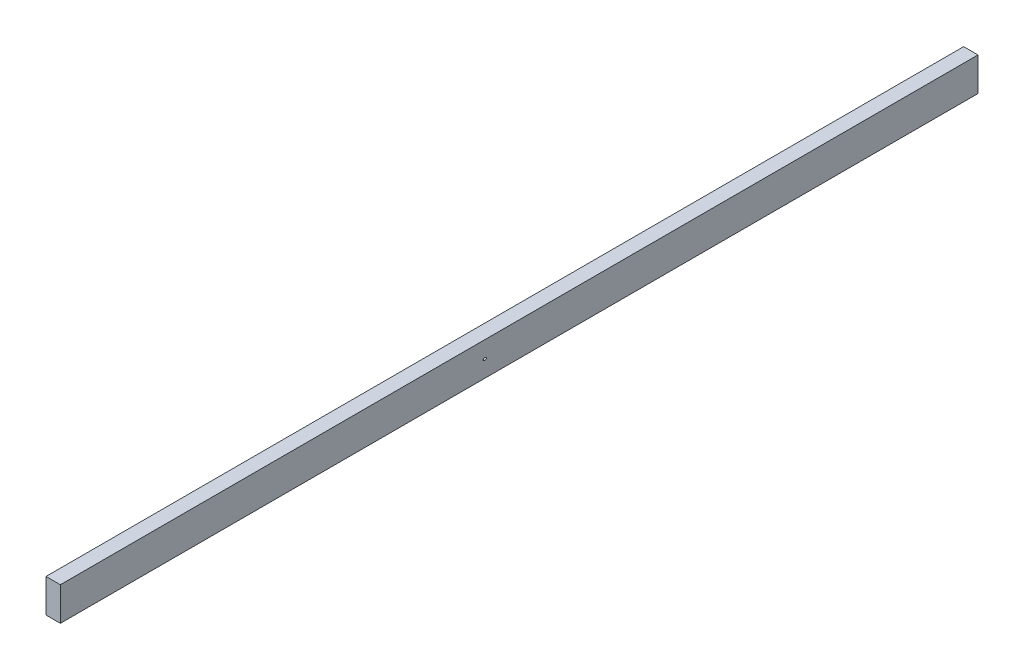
from build123d import *

# Parameters (mm, degrees)
SKETCH1_W               = 38.1
SKETCH1_H               = 88.9
BOSS_EXTRUDE1_DEPTH     = 2438.4
CUT_EXTRUDE1_DEPTH      = 50.8
CUT_EXTRUDE1_DEPTH_BACK = 28.575
SKETCH4_R               = 1.190625
CUT_EXTRUDE2_DEPTH      = 1957.582339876


with BuildPart() as part:
    # Sketch1 → Boss-Extrude1 (new body)
    with BuildSketch(Plane.XY):
        Rectangle(SKETCH1_W, SKETCH1_H)
    extrude(amount=-BOSS_EXTRUDE1_DEPTH)

    # Sketch3 → Cut-Extrude1 (cut, two sides: drawn at the far end of the back side and taken through both)
    with BuildSketch(Plane(origin=(-554.3677, 0, -554.3677), x_dir=(0, -1, 0), z_dir=(0.7071067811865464, 0, 0.7071067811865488)).offset(-CUT_EXTRUDE1_DEPTH_BACK)):
        with BuildLine():
            ThreePointArc((-3.175, 810.935088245), (0, 807.760088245), (3.175, 810.935088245))
            Line((3.175, 810.935088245), (-3.175, 810.935088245))
        make_face()
        with BuildLine():
            Line((-3.175, 810.935088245), (3.175, 810.935088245))
            ThreePointArc((3.175, 810.935088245), (0, 814.110088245), (-3.175, 810.935088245))
        make_face()
        with BuildLine():
            ThreePointArc((-3.175, 810.935088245), (0, 807.760088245), (3.175, 810.935088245))
            Line((3.175, 810.935088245), (-3.175, 810.935088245))
        make_face()
        with BuildLine():
            Line((-3.175, 810.935088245), (3.175, 810.935088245))
            ThreePointArc((3.175, 810.935088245), (0, 814.110088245), (-3.175, 810.935088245))
        make_face()
    extrude(amount=CUT_EXTRUDE1_DEPTH + CUT_EXTRUDE1_DEPTH_BACK, mode=Mode.SUBTRACT)

    # Sketch4 → Cut-Extrude2 (cut, through all)
    with BuildSketch(Plane(origin=(-574.573276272, 0, -574.573276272), x_dir=(0.7071067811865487, 0, -0.7071067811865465), z_dir=(0.7071067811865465, 0, 0.7071067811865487))):
        with Locations((810.935088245, 0)):
            Circle(SKETCH4_R)
    extrude(amount=-CUT_EXTRUDE2_DEPTH, mode=Mode.SUBTRACT)


solid = part.part
